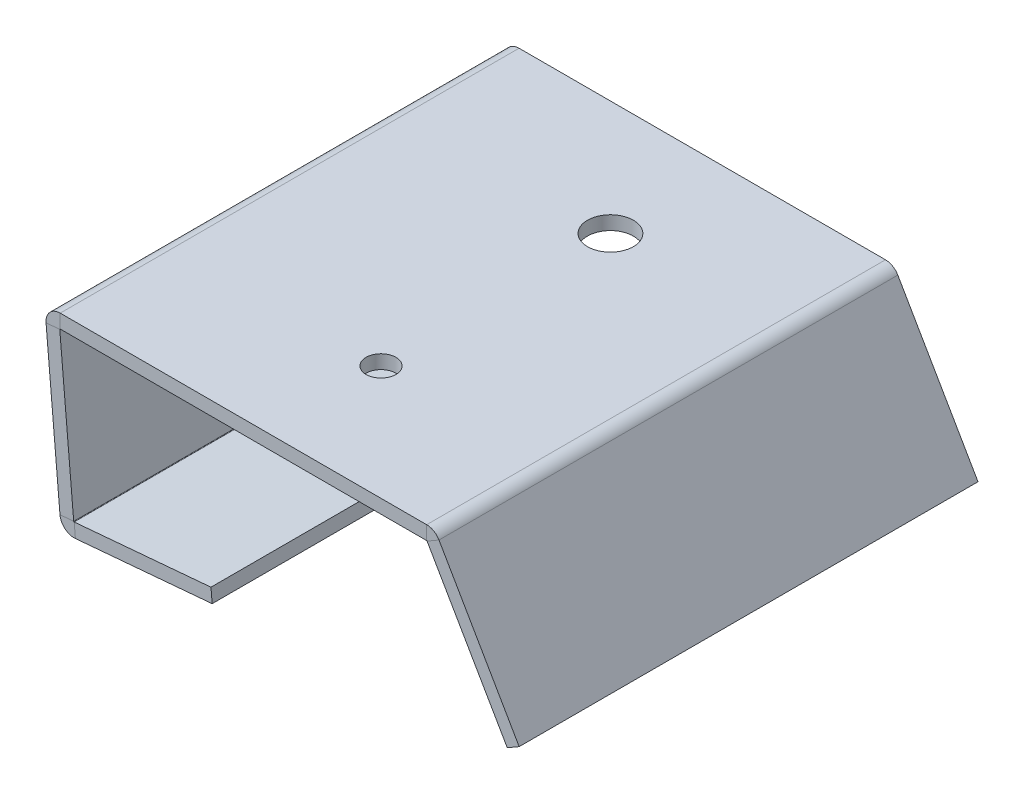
ISO-10303-21;
HEADER;
FILE_DESCRIPTION(('STEP AP214'),'2;1');
FILE_NAME('part.step','',(''),(''),'','','');
FILE_SCHEMA(('AUTOMOTIVE_DESIGN { 1 0 10303 214 1 1 1 1 }'));
ENDSEC;
DATA;
#1=APPLICATION_CONTEXT('core data for automotive mechanical design processes');
#2=APPLICATION_PROTOCOL_DEFINITION('international standard','automotive_design',2000,#1);
#3=PRODUCT_CONTEXT('',#1,'mechanical');
#4=PRODUCT('Part','Part','',(#3));
#5=PRODUCT_RELATED_PRODUCT_CATEGORY('part','',(#4));
#6=PRODUCT_DEFINITION_FORMATION('','',#4);
#7=PRODUCT_DEFINITION_CONTEXT('part definition',#1,'design');
#8=PRODUCT_DEFINITION('design','',#6,#7);
#9=PRODUCT_DEFINITION_SHAPE('','',#8);
#10=(LENGTH_UNIT() NAMED_UNIT(*) SI_UNIT(.MILLI.,.METRE.));
#11=(NAMED_UNIT(*) PLANE_ANGLE_UNIT() SI_UNIT($,.RADIAN.));
#12=(NAMED_UNIT(*) SI_UNIT($,.STERADIAN.) SOLID_ANGLE_UNIT());
#13=UNCERTAINTY_MEASURE_WITH_UNIT(LENGTH_MEASURE(1.E-05),#10,'distance_accuracy_value','');
#14=(GEOMETRIC_REPRESENTATION_CONTEXT(3) GLOBAL_UNCERTAINTY_ASSIGNED_CONTEXT((#13)) GLOBAL_UNIT_ASSIGNED_CONTEXT((#10,
#11,#12)) REPRESENTATION_CONTEXT('',''));
#15=CARTESIAN_POINT('',(0.,0.,0.));
#16=DIRECTION('',(0.,0.,1.));
#17=DIRECTION('',(1.,0.,0.));
#18=AXIS2_PLACEMENT_3D('',#15,#16,#17);
#19=CARTESIAN_POINT('',(0.,0.,-100.));
#20=DIRECTION('',(0.,-1.,0.));
#21=DIRECTION('',(0.,0.,-1.));
#22=AXIS2_PLACEMENT_3D('',#19,#20,#21);
#23=PLANE('',#22);
#24=CARTESIAN_POINT('',(110.,0.,-75.));
#25=DIRECTION('',(0.,1.,0.));
#26=DIRECTION('',(0.,0.,1.));
#27=AXIS2_PLACEMENT_3D('',#24,#25,#26);
#28=CIRCLE('',#27,5.00000000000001);
#29=CARTESIAN_POINT('',(110.,0.,-70.));
#30=VERTEX_POINT('',#29);
#31=EDGE_CURVE('E234',#30,#30,#28,.T.);
#32=ORIENTED_EDGE('',*,*,#31,.T.);
#33=EDGE_LOOP('',(#32));
#34=FACE_BOUND('',#33,.T.);
#35=CARTESIAN_POINT('',(110.,0.,-25.));
#36=DIRECTION('',(0.,1.,0.));
#37=DIRECTION('',(0.,0.,1.));
#38=AXIS2_PLACEMENT_3D('',#35,#36,#37);
#39=CIRCLE('',#38,3.25000000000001);
#40=CARTESIAN_POINT('',(110.,0.,-21.75));
#41=VERTEX_POINT('',#40);
#42=EDGE_CURVE('E231',#41,#41,#39,.T.);
#43=ORIENTED_EDGE('',*,*,#42,.T.);
#44=EDGE_LOOP('',(#43));
#45=FACE_BOUND('',#44,.T.);
#46=DIRECTION('',(-1.,0.,0.));
#47=VECTOR('',#46,1.);
#48=CARTESIAN_POINT('',(0.,0.,-100.));
#49=LINE('',#48,#47);
#50=CARTESIAN_POINT('',(144.947624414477,0.,-100.));
#51=VERTEX_POINT('',#50);
#52=CARTESIAN_POINT('',(65.0829280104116,0.,-100.));
#53=VERTEX_POINT('',#52);
#54=EDGE_CURVE('E73',#51,#53,#49,.T.);
#55=ORIENTED_EDGE('',*,*,#54,.F.);
#56=DIRECTION('',(0.,0.,1.));
#57=VECTOR('',#56,1.);
#58=CARTESIAN_POINT('',(144.947624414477,0.,-100.));
#59=LINE('',#58,#57);
#60=CARTESIAN_POINT('',(144.947624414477,0.,0.));
#61=VERTEX_POINT('',#60);
#62=EDGE_CURVE('E65',#51,#61,#59,.T.);
#63=ORIENTED_EDGE('',*,*,#62,.T.);
#64=DIRECTION('',(1.,0.,0.));
#65=VECTOR('',#64,1.);
#66=CARTESIAN_POINT('',(0.,0.,0.));
#67=LINE('',#66,#65);
#68=CARTESIAN_POINT('',(65.0829280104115,0.,0.));
#69=VERTEX_POINT('',#68);
#70=EDGE_CURVE('E81',#69,#61,#67,.T.);
#71=ORIENTED_EDGE('',*,*,#70,.F.);
#72=DIRECTION('',(0.,0.,1.));
#73=VECTOR('',#72,1.);
#74=CARTESIAN_POINT('',(65.0829280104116,0.,-100.));
#75=LINE('',#74,#73);
#76=EDGE_CURVE('E222',#53,#69,#75,.T.);
#77=ORIENTED_EDGE('',*,*,#76,.F.);
#78=EDGE_LOOP('',(#55,#63,#71,#77));
#79=FACE_BOUND('',#78,.T.);
#80=ADVANCED_FACE('F56',(#34,#45,#79),#23,.T.);
#81=CARTESIAN_POINT('',(70.6412041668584,-64.7787585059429,-100.));
#82=DIRECTION('',(0.996194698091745,0.0871557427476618,0.));
#83=DIRECTION('',(0.,0.,-1.));
#84=AXIS2_PLACEMENT_3D('',#81,#82,#83);
#85=PLANE('',#84);
#86=CARTESIAN_POINT('',(65.847638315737,-9.98805011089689,-50.));
#87=DIRECTION('',(-0.996194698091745,-0.0871557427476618,0.));
#88=DIRECTION('',(0.,0.,1.));
#89=AXIS2_PLACEMENT_3D('',#86,#87,#88);
#90=CIRCLE('',#89,2.25);
#91=CARTESIAN_POINT('',(65.847638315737,-9.98805011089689,-47.75));
#92=VERTEX_POINT('',#91);
#93=EDGE_CURVE('E267',#92,#92,#90,.T.);
#94=ORIENTED_EDGE('',*,*,#93,.T.);
#95=EDGE_LOOP('',(#94));
#96=FACE_BOUND('',#95,.T.);
#97=DIRECTION('',(0.0871557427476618,-0.996194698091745,0.));
#98=VECTOR('',#97,1.);
#99=CARTESIAN_POINT('',(70.6412041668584,-64.7787585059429,-100.));
#100=LINE('',#99,#98);
#101=CARTESIAN_POINT('',(64.9833085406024,-0.108715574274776,-100.));
#102=VERTEX_POINT('',#101);
#103=CARTESIAN_POINT('',(68.0196846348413,-34.8146531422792,-100.));
#104=VERTEX_POINT('',#103);
#105=EDGE_CURVE('E266',#102,#104,#100,.T.);
#106=ORIENTED_EDGE('',*,*,#105,.F.);
#107=DIRECTION('',(0.,0.,1.));
#108=VECTOR('',#107,1.);
#109=CARTESIAN_POINT('',(64.9833085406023,-0.108715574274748,-100.));
#110=LINE('',#109,#108);
#111=CARTESIAN_POINT('',(64.9833085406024,-0.108715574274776,0.));
#112=VERTEX_POINT('',#111);
#113=EDGE_CURVE('E321',#102,#112,#110,.T.);
#114=ORIENTED_EDGE('',*,*,#113,.T.);
#115=DIRECTION('',(-0.0871557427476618,0.996194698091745,0.));
#116=VECTOR('',#115,1.);
#117=CARTESIAN_POINT('',(70.6412041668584,-64.7787585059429,0.));
#118=LINE('',#117,#116);
#119=CARTESIAN_POINT('',(68.0196846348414,-34.8146531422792,0.));
#120=VERTEX_POINT('',#119);
#121=EDGE_CURVE('E270',#120,#112,#118,.T.);
#122=ORIENTED_EDGE('',*,*,#121,.F.);
#123=DIRECTION('',(0.,0.,1.));
#124=VECTOR('',#123,1.);
#125=CARTESIAN_POINT('',(68.0196846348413,-34.8146531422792,-100.));
#126=LINE('',#125,#124);
#127=EDGE_CURVE('E257',#104,#120,#126,.T.);
#128=ORIENTED_EDGE('',*,*,#127,.F.);
#129=EDGE_LOOP('',(#106,#114,#122,#128));
#130=FACE_BOUND('',#129,.T.);
#131=ADVANCED_FACE('F405',(#96,#130),#85,.T.);
#132=CARTESIAN_POINT('',(97.9355962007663,-32.2977320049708,-100.));
#133=DIRECTION('',(-0.0871557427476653,0.996194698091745,0.));
#134=DIRECTION('',(0.,0.,-1.));
#135=AXIS2_PLACEMENT_3D('',#132,#133,#134);
#136=PLANE('',#135);
#137=DIRECTION('',(0.996194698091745,0.0871557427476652,0.));
#138=VECTOR('',#137,1.);
#139=CARTESIAN_POINT('',(97.9355962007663,-32.2977320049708,-100.));
#140=LINE('',#139,#138);
#141=CARTESIAN_POINT('',(68.1280196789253,-34.9055570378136,-100.));
#142=VERTEX_POINT('',#141);
#143=CARTESIAN_POINT('',(97.9355962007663,-32.2977320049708,-100.));
#144=VERTEX_POINT('',#143);
#145=EDGE_CURVE('E287',#142,#144,#140,.T.);
#146=ORIENTED_EDGE('',*,*,#145,.F.);
#147=DIRECTION('',(0.,0.,1.));
#148=VECTOR('',#147,1.);
#149=CARTESIAN_POINT('',(68.1280196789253,-34.9055570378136,-100.));
#150=LINE('',#149,#148);
#151=CARTESIAN_POINT('',(68.1280196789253,-34.9055570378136,0.));
#152=VERTEX_POINT('',#151);
#153=EDGE_CURVE('E304',#142,#152,#150,.T.);
#154=ORIENTED_EDGE('',*,*,#153,.T.);
#155=DIRECTION('',(-0.996194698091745,-0.0871557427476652,0.));
#156=VECTOR('',#155,1.);
#157=CARTESIAN_POINT('',(97.9355962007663,-32.2977320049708,0.));
#158=LINE('',#157,#156);
#159=CARTESIAN_POINT('',(97.9355962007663,-32.2977320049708,0.));
#160=VERTEX_POINT('',#159);
#161=EDGE_CURVE('E290',#160,#152,#158,.T.);
#162=ORIENTED_EDGE('',*,*,#161,.F.);
#163=DIRECTION('',(0.,0.,1.));
#164=VECTOR('',#163,1.);
#165=CARTESIAN_POINT('',(97.9355962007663,-32.2977320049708,0.));
#166=LINE('',#165,#164);
#167=EDGE_CURVE('E265',#144,#160,#166,.T.);
#168=ORIENTED_EDGE('',*,*,#167,.F.);
#169=EDGE_LOOP('',(#146,#154,#162,#168));
#170=FACE_BOUND('',#169,.T.);
#171=ADVANCED_FACE('F431',(#170),#136,.T.);
#172=CARTESIAN_POINT('',(98.1970634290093,-35.286316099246,-100.));
#173=DIRECTION('',(-0.0871557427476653,0.996194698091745,0.));
#174=DIRECTION('',(0.,0.,-1.));
#175=AXIS2_PLACEMENT_3D('',#172,#173,#174);
#176=PLANE('',#175);
#177=DIRECTION('',(0.,0.,1.));
#178=VECTOR('',#177,1.);
#179=CARTESIAN_POINT('',(68.3894869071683,-37.8941411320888,-100.));
#180=LINE('',#179,#178);
#181=CARTESIAN_POINT('',(68.3894869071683,-37.8941411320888,-100.));
#182=VERTEX_POINT('',#181);
#183=CARTESIAN_POINT('',(68.3894869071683,-37.8941411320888,0.));
#184=VERTEX_POINT('',#183);
#185=EDGE_CURVE('E298',#182,#184,#180,.T.);
#186=ORIENTED_EDGE('',*,*,#185,.F.);
#187=DIRECTION('',(0.996194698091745,0.0871557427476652,0.));
#188=VECTOR('',#187,1.);
#189=CARTESIAN_POINT('',(98.1970634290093,-35.286316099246,-100.));
#190=LINE('',#189,#188);
#191=CARTESIAN_POINT('',(98.1970634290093,-35.286316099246,-100.));
#192=VERTEX_POINT('',#191);
#193=EDGE_CURVE('E295',#182,#192,#190,.T.);
#194=ORIENTED_EDGE('',*,*,#193,.T.);
#195=DIRECTION('',(0.,0.,1.));
#196=VECTOR('',#195,1.);
#197=CARTESIAN_POINT('',(98.1970634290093,-35.286316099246,0.));
#198=LINE('',#197,#196);
#199=CARTESIAN_POINT('',(98.1970634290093,-35.286316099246,0.));
#200=VERTEX_POINT('',#199);
#201=EDGE_CURVE('E283',#192,#200,#198,.T.);
#202=ORIENTED_EDGE('',*,*,#201,.T.);
#203=DIRECTION('',(-0.996194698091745,-0.0871557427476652,0.));
#204=VECTOR('',#203,1.);
#205=CARTESIAN_POINT('',(98.1970634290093,-35.286316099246,0.));
#206=LINE('',#205,#204);
#207=EDGE_CURVE('E286',#200,#184,#206,.T.);
#208=ORIENTED_EDGE('',*,*,#207,.T.);
#209=EDGE_LOOP('',(#186,#194,#202,#208));
#210=FACE_BOUND('',#209,.T.);
#211=ADVANCED_FACE('F418',(#210),#176,.F.);
#212=CARTESIAN_POINT('',(98.1970634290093,-35.286316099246,0.));
#213=DIRECTION('',(-0.996194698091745,-0.0871557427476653,0.));
#214=DIRECTION('',(0.,0.,-1.));
#215=AXIS2_PLACEMENT_3D('',#212,#213,#214);
#216=PLANE('',#215);
#217=ORIENTED_EDGE('',*,*,#167,.T.);
#218=DIRECTION('',(-0.0871557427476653,0.996194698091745,0.));
#219=VECTOR('',#218,1.);
#220=CARTESIAN_POINT('',(98.1970634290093,-35.286316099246,0.));
#221=LINE('',#220,#219);
#222=EDGE_CURVE('E294',#200,#160,#221,.T.);
#223=ORIENTED_EDGE('',*,*,#222,.F.);
#224=ORIENTED_EDGE('',*,*,#201,.F.);
#225=DIRECTION('',(-0.0871557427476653,0.996194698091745,0.));
#226=VECTOR('',#225,1.);
#227=CARTESIAN_POINT('',(98.1970634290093,-35.286316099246,-100.));
#228=LINE('',#227,#226);
#229=EDGE_CURVE('E291',#192,#144,#228,.T.);
#230=ORIENTED_EDGE('',*,*,#229,.T.);
#231=EDGE_LOOP('',(#217,#223,#224,#230));
#232=FACE_BOUND('',#231,.T.);
#233=ADVANCED_FACE('F437',(#232),#216,.F.);
#234=CARTESIAN_POINT('',(98.1970634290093,-35.286316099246,0.));
#235=DIRECTION('',(0.,0.,-1.));
#236=DIRECTION('',(0.996194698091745,0.0871557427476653,0.));
#237=AXIS2_PLACEMENT_3D('',#234,#235,#236);
#238=PLANE('',#237);
#239=DIRECTION('',(-0.0871557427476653,0.996194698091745,0.));
#240=VECTOR('',#239,1.);
#241=CARTESIAN_POINT('',(68.3894869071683,-37.8941411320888,0.));
#242=LINE('',#241,#240);
#243=EDGE_CURVE('E301',#184,#152,#242,.T.);
#244=ORIENTED_EDGE('',*,*,#243,.F.);
#245=ORIENTED_EDGE('',*,*,#207,.F.);
#246=ORIENTED_EDGE('',*,*,#222,.T.);
#247=ORIENTED_EDGE('',*,*,#161,.T.);
#248=EDGE_LOOP('',(#244,#245,#246,#247));
#249=FACE_BOUND('',#248,.T.);
#250=ADVANCED_FACE('F434',(#249),#238,.F.);
#251=CARTESIAN_POINT('',(98.1970634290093,-35.286316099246,-100.));
#252=DIRECTION('',(0.,0.,1.));
#253=DIRECTION('',(-0.996194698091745,-0.0871557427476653,0.));
#254=AXIS2_PLACEMENT_3D('',#251,#252,#253);
#255=PLANE('',#254);
#256=DIRECTION('',(0.0871557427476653,-0.996194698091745,0.));
#257=VECTOR('',#256,1.);
#258=CARTESIAN_POINT('',(68.3894869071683,-37.8941411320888,-100.));
#259=LINE('',#258,#257);
#260=EDGE_CURVE('E307',#142,#182,#259,.T.);
#261=ORIENTED_EDGE('',*,*,#260,.F.);
#262=ORIENTED_EDGE('',*,*,#145,.T.);
#263=ORIENTED_EDGE('',*,*,#229,.F.);
#264=ORIENTED_EDGE('',*,*,#193,.F.);
#265=EDGE_LOOP('',(#261,#262,#263,#264));
#266=FACE_BOUND('',#265,.T.);
#267=ADVANCED_FACE('F422',(#266),#255,.F.);
#268=CARTESIAN_POINT('',(62.8590542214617,-10.2495173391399,-50.));
#269=DIRECTION('',(0.996194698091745,0.0871557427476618,0.));
#270=DIRECTION('',(0.,0.,-1.));
#271=AXIS2_PLACEMENT_3D('',#268,#269,#270);
#272=CYLINDRICAL_SURFACE('',#271,2.25);
#273=CARTESIAN_POINT('',(62.8590542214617,-10.2495173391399,-50.));
#274=DIRECTION('',(-0.996194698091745,-0.0871557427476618,0.));
#275=DIRECTION('',(0.,0.,1.));
#276=AXIS2_PLACEMENT_3D('',#273,#274,#275);
#277=CIRCLE('',#276,2.25);
#278=CARTESIAN_POINT('',(62.8590542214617,-10.2495173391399,-47.75));
#279=VERTEX_POINT('',#278);
#280=EDGE_CURVE('E279',#279,#279,#277,.T.);
#281=ORIENTED_EDGE('',*,*,#280,.T.);
#282=EDGE_LOOP('',(#281));
#283=FACE_BOUND('',#282,.T.);
#284=ORIENTED_EDGE('',*,*,#93,.F.);
#285=EDGE_LOOP('',(#284));
#286=FACE_BOUND('',#285,.T.);
#287=ADVANCED_FACE('F467',(#283,#286),#272,.F.);
#288=CARTESIAN_POINT('',(67.6526200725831,-65.0402257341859,-100.));
#289=DIRECTION('',(0.996194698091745,0.0871557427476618,0.));
#290=DIRECTION('',(0.,0.,-1.));
#291=AXIS2_PLACEMENT_3D('',#288,#289,#290);
#292=PLANE('',#291);
#293=DIRECTION('',(0.,0.,1.));
#294=VECTOR('',#293,1.);
#295=CARTESIAN_POINT('',(61.9947244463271,-0.37018280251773,-100.));
#296=LINE('',#295,#294);
#297=CARTESIAN_POINT('',(61.9947244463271,-0.370182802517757,-100.));
#298=VERTEX_POINT('',#297);
#299=CARTESIAN_POINT('',(61.9947244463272,-0.370182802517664,0.));
#300=VERTEX_POINT('',#299);
#301=EDGE_CURVE('E310',#298,#300,#296,.T.);
#302=ORIENTED_EDGE('',*,*,#301,.F.);
#303=DIRECTION('',(0.0871557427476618,-0.996194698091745,0.));
#304=VECTOR('',#303,1.);
#305=CARTESIAN_POINT('',(67.6526200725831,-65.0402257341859,-100.));
#306=LINE('',#305,#304);
#307=CARTESIAN_POINT('',(65.0311005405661,-35.0761203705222,-100.));
#308=VERTEX_POINT('',#307);
#309=EDGE_CURVE('E278',#298,#308,#306,.T.);
#310=ORIENTED_EDGE('',*,*,#309,.T.);
#311=DIRECTION('',(0.,0.,1.));
#312=VECTOR('',#311,1.);
#313=CARTESIAN_POINT('',(65.0311005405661,-35.0761203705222,-100.));
#314=LINE('',#313,#312);
#315=CARTESIAN_POINT('',(65.0311005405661,-35.0761203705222,0.));
#316=VERTEX_POINT('',#315);
#317=EDGE_CURVE('E275',#308,#316,#314,.T.);
#318=ORIENTED_EDGE('',*,*,#317,.T.);
#319=DIRECTION('',(-0.0871557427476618,0.996194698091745,0.));
#320=VECTOR('',#319,1.);
#321=CARTESIAN_POINT('',(67.6526200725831,-65.0402257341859,0.));
#322=LINE('',#321,#320);
#323=EDGE_CURVE('E274',#316,#300,#322,.T.);
#324=ORIENTED_EDGE('',*,*,#323,.T.);
#325=EDGE_LOOP('',(#302,#310,#318,#324));
#326=FACE_BOUND('',#325,.T.);
#327=ORIENTED_EDGE('',*,*,#280,.F.);
#328=EDGE_LOOP('',(#327));
#329=FACE_BOUND('',#328,.T.);
#330=ADVANCED_FACE('F389',(#326,#329),#292,.F.);
#331=CARTESIAN_POINT('',(67.6526200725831,-65.0402257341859,0.));
#332=DIRECTION('',(0.,0.,-1.));
#333=DIRECTION('',(0.0871557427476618,-0.996194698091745,0.));
#334=AXIS2_PLACEMENT_3D('',#331,#332,#333);
#335=PLANE('',#334);
#336=DIRECTION('',(0.996194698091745,0.0871557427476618,0.));
#337=VECTOR('',#336,1.);
#338=CARTESIAN_POINT('',(61.9947244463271,-0.37018280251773,0.));
#339=LINE('',#338,#337);
#340=EDGE_CURVE('E318',#300,#112,#339,.T.);
#341=ORIENTED_EDGE('',*,*,#340,.F.);
#342=ORIENTED_EDGE('',*,*,#323,.F.);
#343=DIRECTION('',(0.996194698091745,0.0871557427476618,0.));
#344=VECTOR('',#343,1.);
#345=CARTESIAN_POINT('',(65.0311005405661,-35.0761203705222,0.));
#346=LINE('',#345,#344);
#347=EDGE_CURVE('E271',#316,#120,#346,.T.);
#348=ORIENTED_EDGE('',*,*,#347,.T.);
#349=ORIENTED_EDGE('',*,*,#121,.T.);
#350=EDGE_LOOP('',(#341,#342,#348,#349));
#351=FACE_BOUND('',#350,.T.);
#352=ADVANCED_FACE('F408',(#351),#335,.F.);
#353=CARTESIAN_POINT('',(67.6526200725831,-65.0402257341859,-100.));
#354=DIRECTION('',(0.,0.,1.));
#355=DIRECTION('',(-0.0871557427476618,0.996194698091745,0.));
#356=AXIS2_PLACEMENT_3D('',#353,#354,#355);
#357=PLANE('',#356);
#358=DIRECTION('',(-0.996194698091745,-0.0871557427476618,0.));
#359=VECTOR('',#358,1.);
#360=CARTESIAN_POINT('',(61.9947244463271,-0.37018280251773,-100.));
#361=LINE('',#360,#359);
#362=EDGE_CURVE('E324',#102,#298,#361,.T.);
#363=ORIENTED_EDGE('',*,*,#362,.F.);
#364=ORIENTED_EDGE('',*,*,#105,.T.);
#365=DIRECTION('',(-0.996194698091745,-0.0871557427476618,0.));
#366=VECTOR('',#365,1.);
#367=CARTESIAN_POINT('',(65.0311005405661,-35.0761203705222,-100.));
#368=LINE('',#367,#366);
#369=EDGE_CURVE('E262',#104,#308,#368,.T.);
#370=ORIENTED_EDGE('',*,*,#369,.T.);
#371=ORIENTED_EDGE('',*,*,#309,.F.);
#372=EDGE_LOOP('',(#363,#364,#370,#371));
#373=FACE_BOUND('',#372,.T.);
#374=ADVANCED_FACE('F395',(#373),#357,.F.);
#375=CARTESIAN_POINT('',(68.1193041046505,-34.8059375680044,-100.));
#376=DIRECTION('',(0.,0.,-1.));
#377=DIRECTION('',(0.0871557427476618,-0.996194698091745,0.));
#378=AXIS2_PLACEMENT_3D('',#375,#376,#377);
#379=PLANE('',#378);
#380=ORIENTED_EDGE('',*,*,#369,.F.);
#381=CARTESIAN_POINT('',(68.1193041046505,-34.8059375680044,-100.));
#382=DIRECTION('',(0.,0.,1.));
#383=DIRECTION('',(-0.0871557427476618,0.996194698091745,0.));
#384=AXIS2_PLACEMENT_3D('',#381,#382,#383);
#385=CIRCLE('',#384,0.0999999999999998);
#386=EDGE_CURVE('E230',#104,#142,#385,.T.);
#387=ORIENTED_EDGE('',*,*,#386,.T.);
#388=ORIENTED_EDGE('',*,*,#260,.T.);
#389=CARTESIAN_POINT('',(68.1193041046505,-34.8059375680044,-100.));
#390=DIRECTION('',(0.,0.,1.));
#391=DIRECTION('',(-0.0871557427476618,0.996194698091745,0.));
#392=AXIS2_PLACEMENT_3D('',#389,#390,#391);
#393=CIRCLE('',#392,3.1);
#394=EDGE_CURVE('E250',#308,#182,#393,.T.);
#395=ORIENTED_EDGE('',*,*,#394,.F.);
#396=EDGE_LOOP('',(#380,#387,#388,#395));
#397=FACE_BOUND('',#396,.T.);
#398=ADVANCED_FACE('F426',(#397),#379,.T.);
#399=CARTESIAN_POINT('',(68.1193041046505,-34.8059375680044,0.));
#400=DIRECTION('',(0.,0.,1.));
#401=DIRECTION('',(-0.0871557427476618,0.996194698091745,0.));
#402=AXIS2_PLACEMENT_3D('',#399,#400,#401);
#403=PLANE('',#402);
#404=ORIENTED_EDGE('',*,*,#243,.T.);
#405=CARTESIAN_POINT('',(68.1193041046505,-34.8059375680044,0.));
#406=DIRECTION('',(0.,0.,1.));
#407=DIRECTION('',(-0.0871557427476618,0.996194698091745,0.));
#408=AXIS2_PLACEMENT_3D('',#405,#406,#407);
#409=CIRCLE('',#408,0.0999999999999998);
#410=EDGE_CURVE('E254',#152,#120,#409,.F.);
#411=ORIENTED_EDGE('',*,*,#410,.T.);
#412=ORIENTED_EDGE('',*,*,#347,.F.);
#413=CARTESIAN_POINT('',(68.1193041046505,-34.8059375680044,0.));
#414=DIRECTION('',(0.,0.,-1.));
#415=DIRECTION('',(0.0871557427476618,-0.996194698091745,0.));
#416=AXIS2_PLACEMENT_3D('',#413,#414,#415);
#417=CIRCLE('',#416,3.1);
#418=EDGE_CURVE('E253',#184,#316,#417,.T.);
#419=ORIENTED_EDGE('',*,*,#418,.F.);
#420=EDGE_LOOP('',(#404,#411,#412,#419));
#421=FACE_BOUND('',#420,.T.);
#422=ADVANCED_FACE('F411',(#421),#403,.T.);
#423=CARTESIAN_POINT('',(68.1193041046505,-34.8059375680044,-150.045113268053));
#424=DIRECTION('',(0.,0.,1.));
#425=DIRECTION('',(-0.0871557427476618,0.996194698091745,0.));
#426=AXIS2_PLACEMENT_3D('',#423,#424,#425);
#427=CYLINDRICAL_SURFACE('',#426,3.1);
#428=ORIENTED_EDGE('',*,*,#418,.T.);
#429=ORIENTED_EDGE('',*,*,#317,.F.);
#430=ORIENTED_EDGE('',*,*,#394,.T.);
#431=ORIENTED_EDGE('',*,*,#185,.T.);
#432=EDGE_LOOP('',(#428,#429,#430,#431));
#433=FACE_BOUND('',#432,.T.);
#434=ADVANCED_FACE('F415',(#433),#427,.T.);
#435=CARTESIAN_POINT('',(68.1193041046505,-34.8059375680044,-150.045113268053));
#436=DIRECTION('',(0.,0.,1.));
#437=DIRECTION('',(-0.0871557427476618,0.996194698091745,0.));
#438=AXIS2_PLACEMENT_3D('',#435,#436,#437);
#439=CYLINDRICAL_SURFACE('',#438,0.0999999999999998);
#440=ORIENTED_EDGE('',*,*,#410,.F.);
#441=ORIENTED_EDGE('',*,*,#153,.F.);
#442=ORIENTED_EDGE('',*,*,#386,.F.);
#443=ORIENTED_EDGE('',*,*,#127,.T.);
#444=EDGE_LOOP('',(#440,#441,#442,#443));
#445=FACE_BOUND('',#444,.T.);
#446=ADVANCED_FACE('F429',(#445),#439,.F.);
#447=CARTESIAN_POINT('',(110.,3.,-25.));
#448=DIRECTION('',(0.,-1.,0.));
#449=DIRECTION('',(0.,0.,-1.));
#450=AXIS2_PLACEMENT_3D('',#447,#448,#449);
#451=CYLINDRICAL_SURFACE('',#450,3.25000000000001);
#452=CARTESIAN_POINT('',(110.,3.,-25.));
#453=DIRECTION('',(0.,1.,0.));
#454=DIRECTION('',(0.,0.,1.));
#455=AXIS2_PLACEMENT_3D('',#452,#453,#454);
#456=CIRCLE('',#455,3.25000000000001);
#457=CARTESIAN_POINT('',(110.,3.,-21.75));
#458=VERTEX_POINT('',#457);
#459=EDGE_CURVE('E246',#458,#458,#456,.T.);
#460=ORIENTED_EDGE('',*,*,#459,.T.);
#461=EDGE_LOOP('',(#460));
#462=FACE_BOUND('',#461,.T.);
#463=ORIENTED_EDGE('',*,*,#42,.F.);
#464=EDGE_LOOP('',(#463));
#465=FACE_BOUND('',#464,.T.);
#466=ADVANCED_FACE('F565',(#462,#465),#451,.F.);
#467=CARTESIAN_POINT('',(110.,3.,-75.));
#468=DIRECTION('',(0.,-1.,0.));
#469=DIRECTION('',(0.,0.,-1.));
#470=AXIS2_PLACEMENT_3D('',#467,#468,#469);
#471=CYLINDRICAL_SURFACE('',#470,5.00000000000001);
#472=CARTESIAN_POINT('',(110.,3.,-75.));
#473=DIRECTION('',(0.,1.,0.));
#474=DIRECTION('',(0.,0.,1.));
#475=AXIS2_PLACEMENT_3D('',#472,#473,#474);
#476=CIRCLE('',#475,5.00000000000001);
#477=CARTESIAN_POINT('',(110.,3.,-70.));
#478=VERTEX_POINT('',#477);
#479=EDGE_CURVE('E243',#478,#478,#476,.T.);
#480=ORIENTED_EDGE('',*,*,#479,.T.);
#481=EDGE_LOOP('',(#480));
#482=FACE_BOUND('',#481,.T.);
#483=ORIENTED_EDGE('',*,*,#31,.F.);
#484=EDGE_LOOP('',(#483));
#485=FACE_BOUND('',#484,.T.);
#486=ADVANCED_FACE('F460',(#482,#485),#471,.F.);
#487=CARTESIAN_POINT('',(0.,3.,-100.));
#488=DIRECTION('',(0.,-1.,0.));
#489=DIRECTION('',(0.,0.,-1.));
#490=AXIS2_PLACEMENT_3D('',#487,#488,#489);
#491=PLANE('',#490);
#492=DIRECTION('',(0.,0.,1.));
#493=VECTOR('',#492,1.);
#494=CARTESIAN_POINT('',(144.947624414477,3.,-100.));
#495=LINE('',#494,#493);
#496=CARTESIAN_POINT('',(144.947624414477,2.99999999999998,-100.));
#497=VERTEX_POINT('',#496);
#498=CARTESIAN_POINT('',(144.947624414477,3.,0.));
#499=VERTEX_POINT('',#498);
#500=EDGE_CURVE('E327',#497,#499,#495,.T.);
#501=ORIENTED_EDGE('',*,*,#500,.F.);
#502=DIRECTION('',(-1.,0.,0.));
#503=VECTOR('',#502,1.);
#504=CARTESIAN_POINT('',(0.,3.,-100.));
#505=LINE('',#504,#503);
#506=CARTESIAN_POINT('',(65.0829280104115,3.,-100.));
#507=VERTEX_POINT('',#506);
#508=EDGE_CURVE('E60',#497,#507,#505,.T.);
#509=ORIENTED_EDGE('',*,*,#508,.T.);
#510=DIRECTION('',(0.,0.,1.));
#511=VECTOR('',#510,1.);
#512=CARTESIAN_POINT('',(65.0829280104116,3.,-100.));
#513=LINE('',#512,#511);
#514=CARTESIAN_POINT('',(65.0829280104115,2.99999999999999,0.));
#515=VERTEX_POINT('',#514);
#516=EDGE_CURVE('E240',#507,#515,#513,.T.);
#517=ORIENTED_EDGE('',*,*,#516,.T.);
#518=DIRECTION('',(1.,0.,0.));
#519=VECTOR('',#518,1.);
#520=CARTESIAN_POINT('',(0.,3.,0.));
#521=LINE('',#520,#519);
#522=EDGE_CURVE('E239',#515,#499,#521,.T.);
#523=ORIENTED_EDGE('',*,*,#522,.T.);
#524=EDGE_LOOP('',(#501,#509,#517,#523));
#525=FACE_BOUND('',#524,.T.);
#526=ORIENTED_EDGE('',*,*,#479,.F.);
#527=EDGE_LOOP('',(#526));
#528=FACE_BOUND('',#527,.T.);
#529=ORIENTED_EDGE('',*,*,#459,.F.);
#530=EDGE_LOOP('',(#529));
#531=FACE_BOUND('',#530,.T.);
#532=ADVANCED_FACE('F343',(#525,#528,#531),#491,.F.);
#533=CARTESIAN_POINT('',(0.,3.,0.));
#534=DIRECTION('',(0.,0.,-1.));
#535=DIRECTION('',(-1.,0.,0.));
#536=AXIS2_PLACEMENT_3D('',#533,#534,#535);
#537=PLANE('',#536);
#538=DIRECTION('',(0.,-1.,0.));
#539=VECTOR('',#538,1.);
#540=CARTESIAN_POINT('',(144.947624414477,3.,0.));
#541=LINE('',#540,#539);
#542=EDGE_CURVE('E335',#499,#61,#541,.T.);
#543=ORIENTED_EDGE('',*,*,#542,.F.);
#544=ORIENTED_EDGE('',*,*,#522,.F.);
#545=DIRECTION('',(0.,-1.,0.));
#546=VECTOR('',#545,1.);
#547=CARTESIAN_POINT('',(65.0829280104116,3.,0.));
#548=LINE('',#547,#546);
#549=EDGE_CURVE('E237',#515,#69,#548,.T.);
#550=ORIENTED_EDGE('',*,*,#549,.T.);
#551=ORIENTED_EDGE('',*,*,#70,.T.);
#552=EDGE_LOOP('',(#543,#544,#550,#551));
#553=FACE_BOUND('',#552,.T.);
#554=ADVANCED_FACE('F346',(#553),#537,.F.);
#555=CARTESIAN_POINT('',(0.,3.,-100.));
#556=DIRECTION('',(0.,0.,1.));
#557=DIRECTION('',(1.,0.,0.));
#558=AXIS2_PLACEMENT_3D('',#555,#556,#557);
#559=PLANE('',#558);
#560=DIRECTION('',(0.,1.,0.));
#561=VECTOR('',#560,1.);
#562=CARTESIAN_POINT('',(144.947624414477,3.,-100.));
#563=LINE('',#562,#561);
#564=EDGE_CURVE('E14',#51,#497,#563,.T.);
#565=ORIENTED_EDGE('',*,*,#564,.F.);
#566=ORIENTED_EDGE('',*,*,#54,.T.);
#567=DIRECTION('',(0.,1.,0.));
#568=VECTOR('',#567,1.);
#569=CARTESIAN_POINT('',(65.0829280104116,3.,-100.));
#570=LINE('',#569,#568);
#571=EDGE_CURVE('E227',#53,#507,#570,.T.);
#572=ORIENTED_EDGE('',*,*,#571,.T.);
#573=ORIENTED_EDGE('',*,*,#508,.F.);
#574=EDGE_LOOP('',(#565,#566,#572,#573));
#575=FACE_BOUND('',#574,.T.);
#576=ADVANCED_FACE('F58',(#575),#559,.F.);
#577=CARTESIAN_POINT('',(65.0829280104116,-0.0999999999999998,-100.));
#578=DIRECTION('',(0.,0.,-1.));
#579=DIRECTION('',(-1.,0.,0.));
#580=AXIS2_PLACEMENT_3D('',#577,#578,#579);
#581=PLANE('',#580);
#582=ORIENTED_EDGE('',*,*,#571,.F.);
#583=CARTESIAN_POINT('',(65.0829280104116,-0.0999999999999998,-100.));
#584=DIRECTION('',(0.,0.,1.));
#585=DIRECTION('',(1.,0.,0.));
#586=AXIS2_PLACEMENT_3D('',#583,#584,#585);
#587=CIRCLE('',#586,0.0999999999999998);
#588=EDGE_CURVE('E209',#53,#102,#587,.T.);
#589=ORIENTED_EDGE('',*,*,#588,.T.);
#590=ORIENTED_EDGE('',*,*,#362,.T.);
#591=CARTESIAN_POINT('',(65.0829280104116,-0.0999999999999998,-100.));
#592=DIRECTION('',(0.,0.,1.));
#593=DIRECTION('',(1.,0.,0.));
#594=AXIS2_PLACEMENT_3D('',#591,#592,#593);
#595=CIRCLE('',#594,3.1);
#596=EDGE_CURVE('E215',#507,#298,#595,.T.);
#597=ORIENTED_EDGE('',*,*,#596,.F.);
#598=EDGE_LOOP('',(#582,#589,#590,#597));
#599=FACE_BOUND('',#598,.T.);
#600=ADVANCED_FACE('F399',(#599),#581,.T.);
#601=CARTESIAN_POINT('',(65.0829280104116,-0.0999999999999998,0.));
#602=DIRECTION('',(0.,0.,1.));
#603=DIRECTION('',(1.,0.,0.));
#604=AXIS2_PLACEMENT_3D('',#601,#602,#603);
#605=PLANE('',#604);
#606=ORIENTED_EDGE('',*,*,#340,.T.);
#607=CARTESIAN_POINT('',(65.0829280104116,-0.0999999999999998,0.));
#608=DIRECTION('',(0.,0.,1.));
#609=DIRECTION('',(1.,0.,0.));
#610=AXIS2_PLACEMENT_3D('',#607,#608,#609);
#611=CIRCLE('',#610,0.0999999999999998);
#612=EDGE_CURVE('E219',#112,#69,#611,.F.);
#613=ORIENTED_EDGE('',*,*,#612,.T.);
#614=ORIENTED_EDGE('',*,*,#549,.F.);
#615=CARTESIAN_POINT('',(65.0829280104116,-0.0999999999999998,0.));
#616=DIRECTION('',(0.,0.,-1.));
#617=DIRECTION('',(-1.,0.,0.));
#618=AXIS2_PLACEMENT_3D('',#615,#616,#617);
#619=CIRCLE('',#618,3.09999999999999);
#620=EDGE_CURVE('E218',#300,#515,#619,.T.);
#621=ORIENTED_EDGE('',*,*,#620,.F.);
#622=EDGE_LOOP('',(#606,#613,#614,#621));
#623=FACE_BOUND('',#622,.T.);
#624=ADVANCED_FACE('F382',(#623),#605,.T.);
#625=CARTESIAN_POINT('',(65.0829280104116,-0.0999999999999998,-150.045127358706));
#626=DIRECTION('',(0.,0.,1.));
#627=DIRECTION('',(1.,0.,0.));
#628=AXIS2_PLACEMENT_3D('',#625,#626,#627);
#629=CYLINDRICAL_SURFACE('',#628,3.1);
#630=ORIENTED_EDGE('',*,*,#620,.T.);
#631=ORIENTED_EDGE('',*,*,#516,.F.);
#632=ORIENTED_EDGE('',*,*,#596,.T.);
#633=ORIENTED_EDGE('',*,*,#301,.T.);
#634=EDGE_LOOP('',(#630,#631,#632,#633));
#635=FACE_BOUND('',#634,.T.);
#636=ADVANCED_FACE('F385',(#635),#629,.T.);
#637=CARTESIAN_POINT('',(65.0829280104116,-0.0999999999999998,-150.045127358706));
#638=DIRECTION('',(0.,0.,1.));
#639=DIRECTION('',(1.,0.,0.));
#640=AXIS2_PLACEMENT_3D('',#637,#638,#639);
#641=CYLINDRICAL_SURFACE('',#640,0.0999999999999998);
#642=ORIENTED_EDGE('',*,*,#612,.F.);
#643=ORIENTED_EDGE('',*,*,#113,.F.);
#644=ORIENTED_EDGE('',*,*,#588,.F.);
#645=ORIENTED_EDGE('',*,*,#76,.T.);
#646=EDGE_LOOP('',(#642,#643,#644,#645));
#647=FACE_BOUND('',#646,.T.);
#648=ADVANCED_FACE('F402',(#647),#641,.F.);
#649=CARTESIAN_POINT('',(144.947624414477,-0.0999999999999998,-100.));
#650=DIRECTION('',(0.,0.,-1.));
#651=DIRECTION('',(-1.,0.,0.));
#652=AXIS2_PLACEMENT_3D('',#649,#650,#651);
#653=PLANE('',#652);
#654=DIRECTION('',(0.86602540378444,0.499999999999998,0.));
#655=VECTOR('',#654,1.);
#656=CARTESIAN_POINT('',(147.632303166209,1.44999999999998,-100.));
#657=LINE('',#656,#655);
#658=CARTESIAN_POINT('',(145.034226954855,-0.0499999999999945,-100.));
#659=VERTEX_POINT('',#658);
#660=CARTESIAN_POINT('',(147.632303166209,1.45000000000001,-100.));
#661=VERTEX_POINT('',#660);
#662=EDGE_CURVE('E369',#659,#661,#657,.T.);
#663=ORIENTED_EDGE('',*,*,#662,.F.);
#664=CARTESIAN_POINT('',(144.947624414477,-0.0999999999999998,-100.));
#665=DIRECTION('',(0.,0.,-1.));
#666=DIRECTION('',(-1.,0.,0.));
#667=AXIS2_PLACEMENT_3D('',#664,#665,#666);
#668=CIRCLE('',#667,0.0999999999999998);
#669=EDGE_CURVE('E211',#659,#51,#668,.F.);
#670=ORIENTED_EDGE('',*,*,#669,.T.);
#671=ORIENTED_EDGE('',*,*,#564,.T.);
#672=CARTESIAN_POINT('',(144.947624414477,-0.0999999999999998,-100.));
#673=DIRECTION('',(0.,0.,1.));
#674=DIRECTION('',(1.,0.,0.));
#675=AXIS2_PLACEMENT_3D('',#672,#673,#674);
#676=CIRCLE('',#675,3.09999999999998);
#677=EDGE_CURVE('E202',#661,#497,#676,.T.);
#678=ORIENTED_EDGE('',*,*,#677,.F.);
#679=EDGE_LOOP('',(#663,#670,#671,#678));
#680=FACE_BOUND('',#679,.T.);
#681=ADVANCED_FACE('F374',(#680),#653,.T.);
#682=CARTESIAN_POINT('',(144.947624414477,-0.0999999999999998,0.));
#683=DIRECTION('',(0.,0.,1.));
#684=DIRECTION('',(1.,0.,0.));
#685=AXIS2_PLACEMENT_3D('',#682,#683,#684);
#686=PLANE('',#685);
#687=ORIENTED_EDGE('',*,*,#542,.T.);
#688=CARTESIAN_POINT('',(144.947624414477,-0.0999999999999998,0.));
#689=DIRECTION('',(0.,0.,-1.));
#690=DIRECTION('',(-1.,0.,0.));
#691=AXIS2_PLACEMENT_3D('',#688,#689,#690);
#692=CIRCLE('',#691,0.0999999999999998);
#693=CARTESIAN_POINT('',(145.034226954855,-0.0499999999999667,0.));
#694=VERTEX_POINT('',#693);
#695=EDGE_CURVE('E206',#61,#694,#692,.T.);
#696=ORIENTED_EDGE('',*,*,#695,.T.);
#697=DIRECTION('',(-0.86602540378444,-0.499999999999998,0.));
#698=VECTOR('',#697,1.);
#699=CARTESIAN_POINT('',(147.632303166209,1.44999999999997,0.));
#700=LINE('',#699,#698);
#701=CARTESIAN_POINT('',(147.632303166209,1.45000000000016,0.));
#702=VERTEX_POINT('',#701);
#703=EDGE_CURVE('E179',#702,#694,#700,.T.);
#704=ORIENTED_EDGE('',*,*,#703,.F.);
#705=CARTESIAN_POINT('',(144.947624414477,-0.0999999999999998,0.));
#706=DIRECTION('',(0.,0.,-1.));
#707=DIRECTION('',(-1.,0.,0.));
#708=AXIS2_PLACEMENT_3D('',#705,#706,#707);
#709=CIRCLE('',#708,3.09999999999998);
#710=EDGE_CURVE('E205',#499,#702,#709,.T.);
#711=ORIENTED_EDGE('',*,*,#710,.F.);
#712=EDGE_LOOP('',(#687,#696,#704,#711));
#713=FACE_BOUND('',#712,.T.);
#714=ADVANCED_FACE('F354',(#713),#686,.T.);
#715=CARTESIAN_POINT('',(144.947624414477,-0.0999999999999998,50.0450447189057));
#716=DIRECTION('',(0.,0.,-1.));
#717=DIRECTION('',(-1.,0.,0.));
#718=AXIS2_PLACEMENT_3D('',#715,#716,#717);
#719=CYLINDRICAL_SURFACE('',#718,3.1);
#720=ORIENTED_EDGE('',*,*,#710,.T.);
#721=DIRECTION('',(0.,0.,1.));
#722=VECTOR('',#721,1.);
#723=CARTESIAN_POINT('',(147.632303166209,1.44999999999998,-100.));
#724=LINE('',#723,#722);
#725=EDGE_CURVE('E361',#661,#702,#724,.T.);
#726=ORIENTED_EDGE('',*,*,#725,.F.);
#727=ORIENTED_EDGE('',*,*,#677,.T.);
#728=ORIENTED_EDGE('',*,*,#500,.T.);
#729=EDGE_LOOP('',(#720,#726,#727,#728));
#730=FACE_BOUND('',#729,.T.);
#731=ADVANCED_FACE('F351',(#730),#719,.T.);
#732=CARTESIAN_POINT('',(144.947624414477,-0.0999999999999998,50.0450447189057));
#733=DIRECTION('',(0.,0.,-1.));
#734=DIRECTION('',(-1.,0.,0.));
#735=AXIS2_PLACEMENT_3D('',#732,#733,#734);
#736=CYLINDRICAL_SURFACE('',#735,0.0999999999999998);
#737=ORIENTED_EDGE('',*,*,#695,.F.);
#738=ORIENTED_EDGE('',*,*,#62,.F.);
#739=ORIENTED_EDGE('',*,*,#669,.F.);
#740=DIRECTION('',(0.,0.,1.));
#741=VECTOR('',#740,1.);
#742=CARTESIAN_POINT('',(145.034226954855,-0.0500000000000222,-100.));
#743=LINE('',#742,#741);
#744=EDGE_CURVE('E196',#659,#694,#743,.T.);
#745=ORIENTED_EDGE('',*,*,#744,.T.);
#746=EDGE_LOOP('',(#737,#738,#739,#745));
#747=FACE_BOUND('',#746,.T.);
#748=ADVANCED_FACE('F379',(#747),#736,.F.);
#749=CARTESIAN_POINT('',(165.106115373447,-28.8155305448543,0.));
#750=DIRECTION('',(-0.499999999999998,0.86602540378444,0.));
#751=DIRECTION('',(0.,0.,1.));
#752=AXIS2_PLACEMENT_3D('',#749,#750,#751);
#753=PLANE('',#752);
#754=DIRECTION('',(0.,0.,-1.));
#755=VECTOR('',#754,1.);
#756=CARTESIAN_POINT('',(162.508039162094,-30.3155305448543,0.));
#757=LINE('',#756,#755);
#758=CARTESIAN_POINT('',(162.508039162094,-30.3155305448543,0.));
#759=VERTEX_POINT('',#758);
#760=CARTESIAN_POINT('',(162.508039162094,-30.3155305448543,-100.));
#761=VERTEX_POINT('',#760);
#762=EDGE_CURVE('E189',#759,#761,#757,.T.);
#763=ORIENTED_EDGE('',*,*,#762,.T.);
#764=DIRECTION('',(-0.86602540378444,-0.499999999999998,0.));
#765=VECTOR('',#764,1.);
#766=CARTESIAN_POINT('',(165.106115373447,-28.8155305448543,-100.));
#767=LINE('',#766,#765);
#768=CARTESIAN_POINT('',(165.106115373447,-28.8155305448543,-100.));
#769=VERTEX_POINT('',#768);
#770=EDGE_CURVE('E214',#769,#761,#767,.T.);
#771=ORIENTED_EDGE('',*,*,#770,.F.);
#772=DIRECTION('',(0.,0.,-1.));
#773=VECTOR('',#772,1.);
#774=CARTESIAN_POINT('',(165.106115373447,-28.8155305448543,0.));
#775=LINE('',#774,#773);
#776=CARTESIAN_POINT('',(165.106115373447,-28.8155305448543,0.));
#777=VERTEX_POINT('',#776);
#778=EDGE_CURVE('E191',#777,#769,#775,.T.);
#779=ORIENTED_EDGE('',*,*,#778,.F.);
#780=DIRECTION('',(-0.86602540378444,-0.499999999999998,0.));
#781=VECTOR('',#780,1.);
#782=CARTESIAN_POINT('',(165.106115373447,-28.8155305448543,0.));
#783=LINE('',#782,#781);
#784=EDGE_CURVE('E176',#777,#759,#783,.T.);
#785=ORIENTED_EDGE('',*,*,#784,.T.);
#786=EDGE_LOOP('',(#763,#771,#779,#785));
#787=FACE_BOUND('',#786,.T.);
#788=ADVANCED_FACE('F187',(#787),#753,.F.);
#789=CARTESIAN_POINT('',(75.1061153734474,127.069042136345,-100.));
#790=DIRECTION('',(-0.86602540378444,-0.499999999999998,0.));
#791=DIRECTION('',(0.,0.,-1.));
#792=AXIS2_PLACEMENT_3D('',#789,#790,#791);
#793=PLANE('',#792);
#794=DIRECTION('',(-0.499999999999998,0.86602540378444,0.));
#795=VECTOR('',#794,1.);
#796=CARTESIAN_POINT('',(75.1061153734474,127.069042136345,-100.));
#797=LINE('',#796,#795);
#798=EDGE_CURVE('E192',#769,#661,#797,.T.);
#799=ORIENTED_EDGE('',*,*,#798,.T.);
#800=ORIENTED_EDGE('',*,*,#725,.T.);
#801=DIRECTION('',(0.499999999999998,-0.86602540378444,0.));
#802=VECTOR('',#801,1.);
#803=CARTESIAN_POINT('',(75.1061153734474,127.069042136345,0.));
#804=LINE('',#803,#802);
#805=EDGE_CURVE('E356',#702,#777,#804,.T.);
#806=ORIENTED_EDGE('',*,*,#805,.T.);
#807=ORIENTED_EDGE('',*,*,#778,.T.);
#808=EDGE_LOOP('',(#799,#800,#806,#807));
#809=FACE_BOUND('',#808,.T.);
#810=ADVANCED_FACE('F366',(#809),#793,.F.);
#811=CARTESIAN_POINT('',(75.1061153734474,127.069042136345,0.));
#812=DIRECTION('',(0.,0.,-1.));
#813=DIRECTION('',(-0.499999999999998,0.86602540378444,0.));
#814=AXIS2_PLACEMENT_3D('',#811,#812,#813);
#815=PLANE('',#814);
#816=ORIENTED_EDGE('',*,*,#805,.F.);
#817=ORIENTED_EDGE('',*,*,#703,.T.);
#818=DIRECTION('',(0.499999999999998,-0.86602540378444,0.));
#819=VECTOR('',#818,1.);
#820=CARTESIAN_POINT('',(72.5080391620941,125.569042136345,0.));
#821=LINE('',#820,#819);
#822=EDGE_CURVE('E173',#694,#759,#821,.T.);
#823=ORIENTED_EDGE('',*,*,#822,.T.);
#824=ORIENTED_EDGE('',*,*,#784,.F.);
#825=EDGE_LOOP('',(#816,#817,#823,#824));
#826=FACE_BOUND('',#825,.T.);
#827=ADVANCED_FACE('F175',(#826),#815,.F.);
#828=CARTESIAN_POINT('',(72.5080391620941,125.569042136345,-100.));
#829=DIRECTION('',(-0.86602540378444,-0.499999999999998,0.));
#830=DIRECTION('',(0.,0.,-1.));
#831=AXIS2_PLACEMENT_3D('',#828,#829,#830);
#832=PLANE('',#831);
#833=ORIENTED_EDGE('',*,*,#744,.F.);
#834=DIRECTION('',(-0.499999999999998,0.86602540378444,0.));
#835=VECTOR('',#834,1.);
#836=CARTESIAN_POINT('',(72.5080391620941,125.569042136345,-100.));
#837=LINE('',#836,#835);
#838=EDGE_CURVE('E184',#761,#659,#837,.T.);
#839=ORIENTED_EDGE('',*,*,#838,.F.);
#840=ORIENTED_EDGE('',*,*,#762,.F.);
#841=ORIENTED_EDGE('',*,*,#822,.F.);
#842=EDGE_LOOP('',(#833,#839,#840,#841));
#843=FACE_BOUND('',#842,.T.);
#844=ADVANCED_FACE('F195',(#843),#832,.T.);
#845=CARTESIAN_POINT('',(75.1061153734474,127.069042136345,-100.));
#846=DIRECTION('',(0.,0.,1.));
#847=DIRECTION('',(0.499999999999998,-0.86602540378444,0.));
#848=AXIS2_PLACEMENT_3D('',#845,#846,#847);
#849=PLANE('',#848);
#850=ORIENTED_EDGE('',*,*,#838,.T.);
#851=ORIENTED_EDGE('',*,*,#662,.T.);
#852=ORIENTED_EDGE('',*,*,#798,.F.);
#853=ORIENTED_EDGE('',*,*,#770,.T.);
#854=EDGE_LOOP('',(#850,#851,#852,#853));
#855=FACE_BOUND('',#854,.T.);
#856=ADVANCED_FACE('F370',(#855),#849,.F.);
#857=CLOSED_SHELL('',(#80,#131,#171,#211,#233,#250,#267,#287,#330,#352,#374,#398,#422,#434,#446,
#466,#486,#532,#554,#576,#600,#624,#636,#648,#681,#714,#731,#748,#788,#810,#827,#844,#856));
#858=MANIFOLD_SOLID_BREP('B2',#857);
#859=ADVANCED_BREP_SHAPE_REPRESENTATION('',(#18,#858),#14);
#860=SHAPE_DEFINITION_REPRESENTATION(#9,#859);
ENDSEC;
END-ISO-10303-21;
